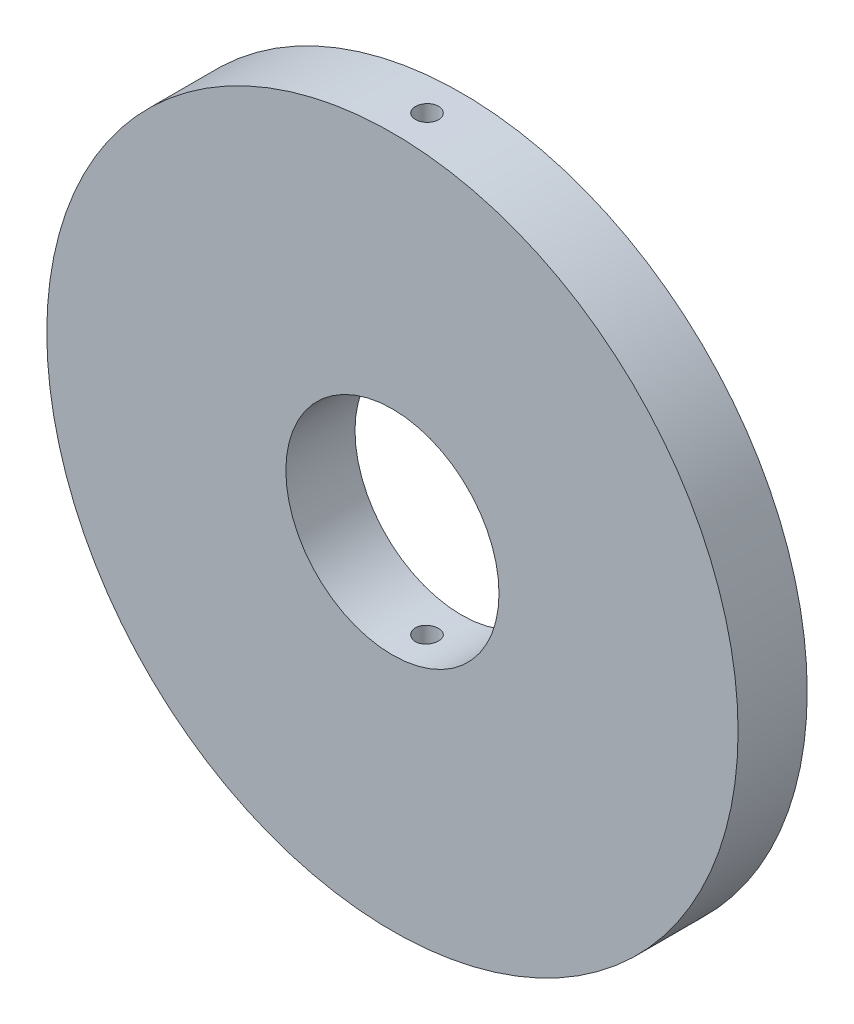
ISO-10303-21;
HEADER;
FILE_DESCRIPTION(('STEP AP214'),'2;1');
FILE_NAME('part.step','',(''),(''),'','','');
FILE_SCHEMA(('AUTOMOTIVE_DESIGN { 1 0 10303 214 1 1 1 1 }'));
ENDSEC;
DATA;
#1=APPLICATION_CONTEXT('core data for automotive mechanical design processes');
#2=APPLICATION_PROTOCOL_DEFINITION('international standard','automotive_design',2000,#1);
#3=PRODUCT_CONTEXT('',#1,'mechanical');
#4=PRODUCT('Part','Part','',(#3));
#5=PRODUCT_RELATED_PRODUCT_CATEGORY('part','',(#4));
#6=PRODUCT_DEFINITION_FORMATION('','',#4);
#7=PRODUCT_DEFINITION_CONTEXT('part definition',#1,'design');
#8=PRODUCT_DEFINITION('design','',#6,#7);
#9=PRODUCT_DEFINITION_SHAPE('','',#8);
#10=(LENGTH_UNIT() NAMED_UNIT(*) SI_UNIT(.MILLI.,.METRE.));
#11=(NAMED_UNIT(*) PLANE_ANGLE_UNIT() SI_UNIT($,.RADIAN.));
#12=(NAMED_UNIT(*) SI_UNIT($,.STERADIAN.) SOLID_ANGLE_UNIT());
#13=UNCERTAINTY_MEASURE_WITH_UNIT(LENGTH_MEASURE(1.E-05),#10,'distance_accuracy_value','');
#14=(GEOMETRIC_REPRESENTATION_CONTEXT(3) GLOBAL_UNCERTAINTY_ASSIGNED_CONTEXT((#13)) GLOBAL_UNIT_ASSIGNED_CONTEXT((#10,
#11,#12)) REPRESENTATION_CONTEXT('',''));
#15=CARTESIAN_POINT('',(0.,0.,0.));
#16=DIRECTION('',(0.,0.,1.));
#17=DIRECTION('',(1.,0.,0.));
#18=AXIS2_PLACEMENT_3D('',#15,#16,#17);
#19=CARTESIAN_POINT('',(0.,0.,6.));
#20=DIRECTION('',(0.,0.,1.));
#21=DIRECTION('',(1.,0.,0.));
#22=AXIS2_PLACEMENT_3D('',#19,#20,#21);
#23=PLANE('',#22);
#24=CARTESIAN_POINT('',(0.,0.,6.));
#25=DIRECTION('',(0.,0.,1.));
#26=DIRECTION('',(1.,0.,0.));
#27=AXIS2_PLACEMENT_3D('',#24,#25,#26);
#28=CIRCLE('',#27,60.);
#29=CARTESIAN_POINT('',(60.,0.,6.));
#30=VERTEX_POINT('',#29);
#31=EDGE_CURVE('E10',#30,#30,#28,.T.);
#32=ORIENTED_EDGE('',*,*,#31,.T.);
#33=EDGE_LOOP('',(#32));
#34=FACE_BOUND('',#33,.T.);
#35=CARTESIAN_POINT('',(0.,0.,6.));
#36=DIRECTION('',(0.,0.,1.));
#37=DIRECTION('',(1.,0.,0.));
#38=AXIS2_PLACEMENT_3D('',#35,#36,#37);
#39=CIRCLE('',#38,18.5);
#40=CARTESIAN_POINT('',(18.5,0.,6.));
#41=VERTEX_POINT('',#40);
#42=EDGE_CURVE('E49',#41,#41,#39,.T.);
#43=ORIENTED_EDGE('',*,*,#42,.F.);
#44=EDGE_LOOP('',(#43));
#45=FACE_BOUND('',#44,.T.);
#46=ADVANCED_FACE('F30',(#34,#45),#23,.T.);
#47=CARTESIAN_POINT('',(0.,0.,-6.));
#48=DIRECTION('',(0.,0.,1.));
#49=DIRECTION('',(1.,0.,0.));
#50=AXIS2_PLACEMENT_3D('',#47,#48,#49);
#51=PLANE('',#50);
#52=CARTESIAN_POINT('',(0.,0.,-6.));
#53=DIRECTION('',(0.,0.,1.));
#54=DIRECTION('',(1.,0.,0.));
#55=AXIS2_PLACEMENT_3D('',#52,#53,#54);
#56=CIRCLE('',#55,60.);
#57=CARTESIAN_POINT('',(60.,0.,-6.));
#58=VERTEX_POINT('',#57);
#59=EDGE_CURVE('E44',#58,#58,#56,.T.);
#60=ORIENTED_EDGE('',*,*,#59,.F.);
#61=EDGE_LOOP('',(#60));
#62=FACE_BOUND('',#61,.T.);
#63=CARTESIAN_POINT('',(0.,0.,-6.));
#64=DIRECTION('',(0.,0.,1.));
#65=DIRECTION('',(1.,0.,0.));
#66=AXIS2_PLACEMENT_3D('',#63,#64,#65);
#67=CIRCLE('',#66,18.5);
#68=CARTESIAN_POINT('',(18.5,0.,-6.));
#69=VERTEX_POINT('',#68);
#70=EDGE_CURVE('E52',#69,#69,#67,.T.);
#71=ORIENTED_EDGE('',*,*,#70,.T.);
#72=EDGE_LOOP('',(#71));
#73=FACE_BOUND('',#72,.T.);
#74=ADVANCED_FACE('F88',(#62,#73),#51,.F.);
#75=CARTESIAN_POINT('',(0.,0.,6.));
#76=DIRECTION('',(0.,0.,-1.));
#77=DIRECTION('',(-1.,0.,0.));
#78=AXIS2_PLACEMENT_3D('',#75,#76,#77);
#79=CYLINDRICAL_SURFACE('',#78,60.);
#80=CARTESIAN_POINT('',(0.,-60.,2.));
#81=CARTESIAN_POINT('',(0.11230741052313,-59.9999995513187,1.99999502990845));
#82=CARTESIAN_POINT('',(0.224695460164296,-59.999681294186,1.99050852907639));
#83=CARTESIAN_POINT('',(0.446374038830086,-59.9984422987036,1.95279792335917));
#84=CARTESIAN_POINT('',(0.555660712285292,-59.9975208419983,1.92455147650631));
#85=CARTESIAN_POINT('',(0.767893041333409,-59.9951797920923,1.85012804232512));
#86=CARTESIAN_POINT('',(0.870841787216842,-59.9937604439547,1.80395987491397));
#87=CARTESIAN_POINT('',(1.06749915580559,-59.9905836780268,1.69501631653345));
#88=CARTESIAN_POINT('',(1.16121001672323,-59.9888263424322,1.63224496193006));
#89=CARTESIAN_POINT('',(1.33680980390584,-59.9851704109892,1.49183842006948));
#90=CARTESIAN_POINT('',(1.41869337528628,-59.9832717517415,1.41419653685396));
#91=CARTESIAN_POINT('',(1.56826901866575,-59.9795477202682,1.24626501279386));
#92=CARTESIAN_POINT('',(1.63596052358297,-59.9777223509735,1.15597486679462));
#93=CARTESIAN_POINT('',(1.75524051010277,-59.9743503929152,0.965287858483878));
#94=CARTESIAN_POINT('',(1.80682553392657,-59.9728038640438,0.864888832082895));
#95=CARTESIAN_POINT('',(1.89240584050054,-59.9701646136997,0.65684939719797));
#96=CARTESIAN_POINT('',(1.92640120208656,-59.969071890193,0.549209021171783));
#97=CARTESIAN_POINT('',(1.97582500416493,-59.9674639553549,0.329785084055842));
#98=CARTESIAN_POINT('',(1.99126039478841,-59.966948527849,0.218003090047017));
#99=CARTESIAN_POINT('',(2.00314751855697,-59.9665526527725,-0.00656652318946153));
#100=CARTESIAN_POINT('',(1.99959933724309,-59.9666722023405,-0.119354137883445));
#101=CARTESIAN_POINT('',(1.97362589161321,-59.9675325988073,-0.342686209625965));
#102=CARTESIAN_POINT('',(1.95120813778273,-59.9682731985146,-0.453231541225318));
#103=CARTESIAN_POINT('',(1.88814352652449,-59.9702918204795,-0.668988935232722));
#104=CARTESIAN_POINT('',(1.84749662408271,-59.9715698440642,-0.774200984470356));
#105=CARTESIAN_POINT('',(1.74911891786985,-59.9745195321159,-0.976329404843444));
#106=CARTESIAN_POINT('',(1.69138467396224,-59.9761912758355,-1.07324410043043));
#107=CARTESIAN_POINT('',(1.56047369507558,-59.979739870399,-1.25600838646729));
#108=CARTESIAN_POINT('',(1.48729691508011,-59.981616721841,-1.3418579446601));
#109=CARTESIAN_POINT('',(1.32753561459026,-59.9853650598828,-1.50009874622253));
#110=CARTESIAN_POINT('',(1.24094458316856,-59.9872365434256,-1.57248341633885));
#111=CARTESIAN_POINT('',(1.05683574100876,-59.990762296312,-1.70168908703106));
#112=CARTESIAN_POINT('',(0.959317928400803,-59.9924165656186,-1.7585100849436));
#113=CARTESIAN_POINT('',(0.756120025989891,-59.9953214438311,-1.85497474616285));
#114=CARTESIAN_POINT('',(0.650439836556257,-59.9965720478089,-1.89461819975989));
#115=CARTESIAN_POINT('',(0.433918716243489,-59.9985285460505,-1.95559822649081));
#116=CARTESIAN_POINT('',(0.323077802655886,-59.9992344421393,-1.97693486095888));
#117=CARTESIAN_POINT('',(0.0994387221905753,-60.0000217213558,-2.00068751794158));
#118=CARTESIAN_POINT('',(-0.0133584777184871,-60.0001034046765,-2.00311263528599));
#119=CARTESIAN_POINT('',(-0.237758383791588,-59.9996338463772,-1.98899712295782));
#120=CARTESIAN_POINT('',(-0.349361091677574,-59.9990826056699,-1.97245652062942));
#121=CARTESIAN_POINT('',(-0.568178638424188,-59.9974095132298,-1.92088662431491));
#122=CARTESIAN_POINT('',(-0.675394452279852,-59.9962877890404,-1.88586146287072));
#123=CARTESIAN_POINT('',(-0.882424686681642,-59.9936001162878,-1.79832087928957));
#124=CARTESIAN_POINT('',(-0.982239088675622,-59.9920341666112,-1.74580541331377));
#125=CARTESIAN_POINT('',(-1.17167497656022,-59.9886336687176,-1.62475154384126));
#126=CARTESIAN_POINT('',(-1.26129255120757,-59.9867990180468,-1.55620702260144));
#127=CARTESIAN_POINT('',(-1.42775157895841,-59.9830682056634,-1.40504974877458));
#128=CARTESIAN_POINT('',(-1.50459299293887,-59.9811720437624,-1.32243695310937));
#129=CARTESIAN_POINT('',(-1.64334885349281,-59.977531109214,-1.14544921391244));
#130=CARTESIAN_POINT('',(-1.70525742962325,-59.9757863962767,-1.05106966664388));
#131=CARTESIAN_POINT('',(-1.81235012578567,-59.9726460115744,-0.853250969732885));
#132=CARTESIAN_POINT('',(-1.85753428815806,-59.9712503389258,-0.749811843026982));
#133=CARTESIAN_POINT('',(-1.92988526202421,-59.96896582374,-0.536832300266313));
#134=CARTESIAN_POINT('',(-1.95705586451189,-59.9680768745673,-0.427293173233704));
#135=CARTESIAN_POINT('',(-1.99262086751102,-59.9669057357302,-0.205204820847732));
#136=CARTESIAN_POINT('',(-2.00101529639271,-59.9666235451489,-0.0926556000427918));
#137=CARTESIAN_POINT('',(-1.99878923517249,-59.96669777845,0.132199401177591));
#138=CARTESIAN_POINT('',(-1.98817799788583,-59.9670538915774,0.244505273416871));
#139=CARTESIAN_POINT('',(-1.94826086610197,-59.968363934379,0.465740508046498));
#140=CARTESIAN_POINT('',(-1.91895493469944,-59.9693178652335,0.574669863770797));
#141=CARTESIAN_POINT('',(-1.84248173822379,-59.9717159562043,0.786063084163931));
#142=CARTESIAN_POINT('',(-1.79531418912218,-59.9731601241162,0.888526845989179));
#143=CARTESIAN_POINT('',(-1.68445939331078,-59.9763758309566,1.0840795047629));
#144=CARTESIAN_POINT('',(-1.62077273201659,-59.9781473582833,1.1771687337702));
#145=CARTESIAN_POINT('',(-1.47865855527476,-59.9818189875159,1.35137347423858));
#146=CARTESIAN_POINT('',(-1.40022544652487,-59.9837191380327,1.43248442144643));
#147=CARTESIAN_POINT('',(-1.23083249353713,-59.9874337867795,1.58041021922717));
#148=CARTESIAN_POINT('',(-1.13986955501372,-59.9892482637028,1.64722152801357));
#149=CARTESIAN_POINT('',(-0.947958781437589,-59.9925877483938,1.76466546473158));
#150=CARTESIAN_POINT('',(-0.847004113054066,-59.994112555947,1.81528691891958));
#151=CARTESIAN_POINT('',(-0.638101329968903,-59.9966973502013,1.89880272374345));
#152=CARTESIAN_POINT('',(-0.530161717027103,-59.997757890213,1.93171818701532));
#153=CARTESIAN_POINT('',(-0.351284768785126,-59.9990115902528,1.97017649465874));
#154=CARTESIAN_POINT('',(-0.281508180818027,-59.9993806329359,1.98134620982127));
#155=CARTESIAN_POINT('',(-0.141165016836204,-59.9998749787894,1.99625952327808));
#156=CARTESIAN_POINT('',(-0.0705984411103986,-60.0000002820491,2.00000312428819));
#157=CARTESIAN_POINT('',(0.,-60.,2.));
#158=B_SPLINE_CURVE_WITH_KNOTS('',3,(#80,#81,#82,#83,#84,#85,#86,#87,#88,#89,#90,#91,#92,#93,
#94,#95,#96,#97,#98,#99,#100,#101,#102,#103,#104,#105,#106,#107,#108,#109,#110,#111,#112,#113,
#114,#115,#116,#117,#118,#119,#120,#121,#122,#123,#124,#125,#126,#127,#128,#129,#130,#131,#132,
#133,#134,#135,#136,#137,#138,#139,#140,#141,#142,#143,#144,#145,#146,#147,#148,#149,#150,#151,
#152,#153,#154,#155,#156,#157),.UNSPECIFIED.,.T.,.F.,(4,2,2,2,2,2,2,2,2,2,2,2,2,2,2,2,2,2,2,2,2,
2,2,2,2,2,2,2,2,2,2,2,2,2,2,2,2,2,4),(0.,0.336664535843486,0.673730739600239,1.0106312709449,
1.34744997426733,1.68442069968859,2.02140488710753,2.3584613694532,2.69551634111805,
3.03244505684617,3.3693722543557,3.70616541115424,4.04295939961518,4.37982123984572,
4.71668406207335,5.05371090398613,5.39073780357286,5.72776881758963,6.06479870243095,
6.40166649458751,6.73853380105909,7.07532582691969,7.41211869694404,7.74904031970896,
8.08596297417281,8.42301786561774,8.76007190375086,9.09705498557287,9.43403755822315,
9.77085611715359,10.1076753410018,10.4444999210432,10.7813125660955,11.1182532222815,
11.4552772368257,11.7925333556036,12.129386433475,12.3410198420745,12.5526531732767),.UNSPECIFIED.);
#159=CARTESIAN_POINT('',(0.,-60.,2.));
#160=VERTEX_POINT('',#159);
#161=EDGE_CURVE('E77',#160,#160,#158,.T.);
#162=ORIENTED_EDGE('',*,*,#161,.T.);
#163=EDGE_LOOP('',(#162));
#164=FACE_BOUND('',#163,.T.);
#165=CARTESIAN_POINT('',(0.,60.,2.));
#166=CARTESIAN_POINT('',(-0.11230741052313,59.9999995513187,1.99999502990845));
#167=CARTESIAN_POINT('',(-0.224695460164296,59.999681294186,1.99050852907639));
#168=CARTESIAN_POINT('',(-0.446374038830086,59.9984422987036,1.95279792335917));
#169=CARTESIAN_POINT('',(-0.555660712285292,59.9975208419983,1.92455147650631));
#170=CARTESIAN_POINT('',(-0.767893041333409,59.9951797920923,1.85012804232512));
#171=CARTESIAN_POINT('',(-0.870841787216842,59.9937604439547,1.80395987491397));
#172=CARTESIAN_POINT('',(-1.06749915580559,59.9905836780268,1.69501631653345));
#173=CARTESIAN_POINT('',(-1.16121001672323,59.9888263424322,1.63224496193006));
#174=CARTESIAN_POINT('',(-1.33680980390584,59.9851704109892,1.49183842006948));
#175=CARTESIAN_POINT('',(-1.41869337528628,59.9832717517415,1.41419653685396));
#176=CARTESIAN_POINT('',(-1.56826901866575,59.9795477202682,1.24626501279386));
#177=CARTESIAN_POINT('',(-1.63596052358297,59.9777223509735,1.15597486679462));
#178=CARTESIAN_POINT('',(-1.75524051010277,59.9743503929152,0.965287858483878));
#179=CARTESIAN_POINT('',(-1.80682553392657,59.9728038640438,0.864888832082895));
#180=CARTESIAN_POINT('',(-1.89240584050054,59.9701646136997,0.65684939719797));
#181=CARTESIAN_POINT('',(-1.92640120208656,59.969071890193,0.549209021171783));
#182=CARTESIAN_POINT('',(-1.97582500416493,59.9674639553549,0.329785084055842));
#183=CARTESIAN_POINT('',(-1.99126039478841,59.966948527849,0.218003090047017));
#184=CARTESIAN_POINT('',(-2.00314751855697,59.9665526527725,-0.00656652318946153));
#185=CARTESIAN_POINT('',(-1.99959933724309,59.9666722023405,-0.119354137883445));
#186=CARTESIAN_POINT('',(-1.97362589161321,59.9675325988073,-0.342686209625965));
#187=CARTESIAN_POINT('',(-1.95120813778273,59.9682731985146,-0.453231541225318));
#188=CARTESIAN_POINT('',(-1.88814352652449,59.9702918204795,-0.668988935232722));
#189=CARTESIAN_POINT('',(-1.84749662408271,59.9715698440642,-0.774200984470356));
#190=CARTESIAN_POINT('',(-1.74911891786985,59.9745195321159,-0.976329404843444));
#191=CARTESIAN_POINT('',(-1.69138467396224,59.9761912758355,-1.07324410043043));
#192=CARTESIAN_POINT('',(-1.56047369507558,59.979739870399,-1.25600838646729));
#193=CARTESIAN_POINT('',(-1.48729691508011,59.981616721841,-1.3418579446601));
#194=CARTESIAN_POINT('',(-1.32753561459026,59.9853650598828,-1.50009874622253));
#195=CARTESIAN_POINT('',(-1.24094458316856,59.9872365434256,-1.57248341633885));
#196=CARTESIAN_POINT('',(-1.05683574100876,59.990762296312,-1.70168908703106));
#197=CARTESIAN_POINT('',(-0.959317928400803,59.9924165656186,-1.7585100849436));
#198=CARTESIAN_POINT('',(-0.756120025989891,59.9953214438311,-1.85497474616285));
#199=CARTESIAN_POINT('',(-0.650439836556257,59.9965720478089,-1.89461819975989));
#200=CARTESIAN_POINT('',(-0.433918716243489,59.9985285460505,-1.95559822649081));
#201=CARTESIAN_POINT('',(-0.323077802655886,59.9992344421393,-1.97693486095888));
#202=CARTESIAN_POINT('',(-0.0994387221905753,60.0000217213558,-2.00068751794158));
#203=CARTESIAN_POINT('',(0.0133584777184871,60.0001034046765,-2.00311263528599));
#204=CARTESIAN_POINT('',(0.237758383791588,59.9996338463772,-1.98899712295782));
#205=CARTESIAN_POINT('',(0.349361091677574,59.9990826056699,-1.97245652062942));
#206=CARTESIAN_POINT('',(0.568178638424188,59.9974095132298,-1.92088662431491));
#207=CARTESIAN_POINT('',(0.675394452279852,59.9962877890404,-1.88586146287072));
#208=CARTESIAN_POINT('',(0.882424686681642,59.9936001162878,-1.79832087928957));
#209=CARTESIAN_POINT('',(0.982239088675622,59.9920341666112,-1.74580541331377));
#210=CARTESIAN_POINT('',(1.17167497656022,59.9886336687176,-1.62475154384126));
#211=CARTESIAN_POINT('',(1.26129255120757,59.9867990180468,-1.55620702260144));
#212=CARTESIAN_POINT('',(1.42775157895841,59.9830682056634,-1.40504974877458));
#213=CARTESIAN_POINT('',(1.50459299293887,59.9811720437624,-1.32243695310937));
#214=CARTESIAN_POINT('',(1.64334885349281,59.977531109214,-1.14544921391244));
#215=CARTESIAN_POINT('',(1.70525742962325,59.9757863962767,-1.05106966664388));
#216=CARTESIAN_POINT('',(1.81235012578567,59.9726460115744,-0.853250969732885));
#217=CARTESIAN_POINT('',(1.85753428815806,59.9712503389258,-0.749811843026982));
#218=CARTESIAN_POINT('',(1.92988526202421,59.96896582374,-0.536832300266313));
#219=CARTESIAN_POINT('',(1.95705586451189,59.9680768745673,-0.427293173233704));
#220=CARTESIAN_POINT('',(1.99262086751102,59.9669057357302,-0.205204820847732));
#221=CARTESIAN_POINT('',(2.00101529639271,59.9666235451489,-0.0926556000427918));
#222=CARTESIAN_POINT('',(1.99878923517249,59.96669777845,0.132199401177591));
#223=CARTESIAN_POINT('',(1.98817799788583,59.9670538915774,0.244505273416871));
#224=CARTESIAN_POINT('',(1.94826086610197,59.968363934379,0.465740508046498));
#225=CARTESIAN_POINT('',(1.91895493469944,59.9693178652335,0.574669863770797));
#226=CARTESIAN_POINT('',(1.84248173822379,59.9717159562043,0.786063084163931));
#227=CARTESIAN_POINT('',(1.79531418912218,59.9731601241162,0.888526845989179));
#228=CARTESIAN_POINT('',(1.68445939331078,59.9763758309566,1.0840795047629));
#229=CARTESIAN_POINT('',(1.62077273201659,59.9781473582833,1.1771687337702));
#230=CARTESIAN_POINT('',(1.47865855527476,59.9818189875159,1.35137347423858));
#231=CARTESIAN_POINT('',(1.40022544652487,59.9837191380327,1.43248442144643));
#232=CARTESIAN_POINT('',(1.23083249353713,59.9874337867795,1.58041021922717));
#233=CARTESIAN_POINT('',(1.13986955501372,59.9892482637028,1.64722152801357));
#234=CARTESIAN_POINT('',(0.947958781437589,59.9925877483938,1.76466546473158));
#235=CARTESIAN_POINT('',(0.847004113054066,59.994112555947,1.81528691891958));
#236=CARTESIAN_POINT('',(0.638101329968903,59.9966973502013,1.89880272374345));
#237=CARTESIAN_POINT('',(0.530161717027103,59.997757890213,1.93171818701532));
#238=CARTESIAN_POINT('',(0.351284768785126,59.9990115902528,1.97017649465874));
#239=CARTESIAN_POINT('',(0.281508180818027,59.9993806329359,1.98134620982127));
#240=CARTESIAN_POINT('',(0.141165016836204,59.9998749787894,1.99625952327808));
#241=CARTESIAN_POINT('',(0.0705984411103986,60.0000002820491,2.00000312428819));
#242=CARTESIAN_POINT('',(0.,60.,2.));
#243=B_SPLINE_CURVE_WITH_KNOTS('',3,(#165,#166,#167,#168,#169,#170,#171,#172,#173,#174,#175,
#176,#177,#178,#179,#180,#181,#182,#183,#184,#185,#186,#187,#188,#189,#190,#191,#192,#193,#194,
#195,#196,#197,#198,#199,#200,#201,#202,#203,#204,#205,#206,#207,#208,#209,#210,#211,#212,#213,
#214,#215,#216,#217,#218,#219,#220,#221,#222,#223,#224,#225,#226,#227,#228,#229,#230,#231,#232,
#233,#234,#235,#236,#237,#238,#239,#240,#241,#242),.UNSPECIFIED.,.T.,.F.,(4,2,2,2,2,2,2,2,2,2,2,
2,2,2,2,2,2,2,2,2,2,2,2,2,2,2,2,2,2,2,2,2,2,2,2,2,2,2,4),(0.,0.336664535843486,
0.673730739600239,1.0106312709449,1.34744997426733,1.68442069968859,2.02140488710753,
2.3584613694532,2.69551634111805,3.03244505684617,3.3693722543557,3.70616541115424,
4.04295939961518,4.37982123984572,4.71668406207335,5.05371090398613,5.39073780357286,
5.72776881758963,6.06479870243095,6.40166649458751,6.73853380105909,7.07532582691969,
7.41211869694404,7.74904031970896,8.08596297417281,8.42301786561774,8.76007190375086,
9.09705498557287,9.43403755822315,9.77085611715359,10.1076753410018,10.4444999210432,
10.7813125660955,11.1182532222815,11.4552772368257,11.7925333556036,12.129386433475,
12.3410198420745,12.5526531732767),.UNSPECIFIED.);
#244=CARTESIAN_POINT('',(0.,60.,2.));
#245=VERTEX_POINT('',#244);
#246=EDGE_CURVE('E72',#245,#245,#243,.T.);
#247=ORIENTED_EDGE('',*,*,#246,.T.);
#248=EDGE_LOOP('',(#247));
#249=FACE_BOUND('',#248,.T.);
#250=ORIENTED_EDGE('',*,*,#31,.F.);
#251=EDGE_LOOP('',(#250));
#252=FACE_BOUND('',#251,.T.);
#253=ORIENTED_EDGE('',*,*,#59,.T.);
#254=EDGE_LOOP('',(#253));
#255=FACE_BOUND('',#254,.T.);
#256=ADVANCED_FACE('F32',(#164,#249,#252,#255),#79,.T.);
#257=CARTESIAN_POINT('',(0.,0.,6.));
#258=DIRECTION('',(0.,0.,-1.));
#259=DIRECTION('',(-1.,0.,0.));
#260=AXIS2_PLACEMENT_3D('',#257,#258,#259);
#261=CYLINDRICAL_SURFACE('',#260,18.5);
#262=CARTESIAN_POINT('',(0.,-18.5,2.));
#263=CARTESIAN_POINT('',(0.111990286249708,-18.499998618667,1.9999951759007));
#264=CARTESIAN_POINT('',(0.224053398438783,-18.4989723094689,1.99056194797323));
#265=CARTESIAN_POINT('',(0.44506934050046,-18.4949768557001,1.95307530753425));
#266=CARTESIAN_POINT('',(0.554018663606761,-18.4920056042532,1.92500170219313));
#267=CARTESIAN_POINT('',(0.765574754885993,-18.4844554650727,1.85106413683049));
#268=CARTESIAN_POINT('',(0.868185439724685,-18.4798775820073,1.80521129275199));
#269=CARTESIAN_POINT('',(1.06423297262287,-18.4696252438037,1.69703928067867));
#270=CARTESIAN_POINT('',(1.1576715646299,-18.4639509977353,1.63472325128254));
#271=CARTESIAN_POINT('',(1.33313392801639,-18.4521144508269,1.49511510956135));
#272=CARTESIAN_POINT('',(1.41511399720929,-18.4459504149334,1.41776821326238));
#273=CARTESIAN_POINT('',(1.56495633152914,-18.4338432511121,1.25041109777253));
#274=CARTESIAN_POINT('',(1.63281792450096,-18.4279001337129,1.16040027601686));
#275=CARTESIAN_POINT('',(1.75265443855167,-18.4168902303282,0.969993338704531));
#276=CARTESIAN_POINT('',(1.80458934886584,-18.4118256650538,0.869571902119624));
#277=CARTESIAN_POINT('',(1.89084277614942,-18.4031683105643,0.661369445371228));
#278=CARTESIAN_POINT('',(1.92516179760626,-18.399575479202,0.553588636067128));
#279=CARTESIAN_POINT('',(1.97507860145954,-18.3942843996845,0.334175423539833));
#280=CARTESIAN_POINT('',(1.99074932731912,-18.3925787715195,0.222559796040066));
#281=CARTESIAN_POINT('',(2.00315025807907,-18.3912324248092,-0.00172931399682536));
#282=CARTESIAN_POINT('',(1.99988103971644,-18.3915916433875,-0.114402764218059));
#283=CARTESIAN_POINT('',(1.974554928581,-18.3943276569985,-0.337104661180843));
#284=CARTESIAN_POINT('',(1.95257788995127,-18.3966958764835,-0.447142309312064));
#285=CARTESIAN_POINT('',(1.89058433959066,-18.4031696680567,-0.661958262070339));
#286=CARTESIAN_POINT('',(1.85056754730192,-18.407275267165,-0.766736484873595));
#287=CARTESIAN_POINT('',(1.75354297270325,-18.4167710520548,-0.968310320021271));
#288=CARTESIAN_POINT('',(1.69649998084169,-18.4221638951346,-1.06508885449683));
#289=CARTESIAN_POINT('',(1.56706751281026,-18.4336243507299,-1.2477291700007));
#290=CARTESIAN_POINT('',(1.49467751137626,-18.4396919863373,-1.33359057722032));
#291=CARTESIAN_POINT('',(1.33616094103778,-18.4518565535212,-1.49242322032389));
#292=CARTESIAN_POINT('',(1.24996544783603,-18.4579534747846,-1.5653256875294));
#293=CARTESIAN_POINT('',(1.06652339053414,-18.4694601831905,-1.69563727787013));
#294=CARTESIAN_POINT('',(0.969276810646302,-18.4748699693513,-1.75304637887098));
#295=CARTESIAN_POINT('',(0.766443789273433,-18.4843950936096,-1.85073968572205));
#296=CARTESIAN_POINT('',(0.660855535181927,-18.4885101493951,-1.89102015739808));
#297=CARTESIAN_POINT('',(0.444359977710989,-18.4949793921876,-1.95326113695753));
#298=CARTESIAN_POINT('',(0.333452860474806,-18.4973336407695,-1.97522228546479));
#299=CARTESIAN_POINT('',(0.110063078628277,-18.5000080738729,-2.00011341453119));
#300=CARTESIAN_POINT('',(-0.00240890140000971,-18.5003383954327,-2.00313824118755));
#301=CARTESIAN_POINT('',(-0.22625817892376,-18.4989549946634,-1.99032033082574));
#302=CARTESIAN_POINT('',(-0.337635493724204,-18.4972413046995,-1.97447789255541));
#303=CARTESIAN_POINT('',(-0.555858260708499,-18.4919688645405,-1.92445388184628));
#304=CARTESIAN_POINT('',(-0.662714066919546,-18.4884146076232,-1.89031696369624));
#305=CARTESIAN_POINT('',(-0.869183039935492,-18.47985951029,-1.80471906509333));
#306=CARTESIAN_POINT('',(-0.968796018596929,-18.4748586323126,-1.75325763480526));
#307=CARTESIAN_POINT('',(-1.15837895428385,-18.4639438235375,-1.63423802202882));
#308=CARTESIAN_POINT('',(-1.24830976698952,-18.4580264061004,-1.5666178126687));
#309=CARTESIAN_POINT('',(-1.4155787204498,-18.4459530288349,-1.41728870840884));
#310=CARTESIAN_POINT('',(-1.49291649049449,-18.4397970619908,-1.33557939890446));
#311=CARTESIAN_POINT('',(-1.63313551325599,-18.4279096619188,-1.15997646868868));
#312=CARTESIAN_POINT('',(-1.6959543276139,-18.4221801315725,-1.06603284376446));
#313=CARTESIAN_POINT('',(-1.80492238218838,-18.4118240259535,-0.868873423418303));
#314=CARTESIAN_POINT('',(-1.85107188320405,-18.4071974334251,-0.765657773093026));
#315=CARTESIAN_POINT('',(-1.92528779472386,-18.3995832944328,-0.553094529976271));
#316=CARTESIAN_POINT('',(-1.9533907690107,-18.3965924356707,-0.443759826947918));
#317=CARTESIAN_POINT('',(-1.99083427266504,-18.3925783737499,-0.221889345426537));
#318=CARTESIAN_POINT('',(-2.00017543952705,-18.3915551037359,-0.109353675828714));
#319=CARTESIAN_POINT('',(-1.9998204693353,-18.3915936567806,0.115103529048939));
#320=CARTESIAN_POINT('',(-1.99022241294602,-18.3926447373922,0.227025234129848));
#321=CARTESIAN_POINT('',(-1.95246771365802,-18.3966906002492,0.447655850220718));
#322=CARTESIAN_POINT('',(-1.92431105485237,-18.3996853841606,0.556364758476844));
#323=CARTESIAN_POINT('',(-1.85026659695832,-18.4072781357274,0.767479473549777));
#324=CARTESIAN_POINT('',(-1.80438224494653,-18.411875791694,0.869886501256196));
#325=CARTESIAN_POINT('',(-1.69619478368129,-18.4221568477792,1.06556188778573));
#326=CARTESIAN_POINT('',(-1.63389167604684,-18.4278402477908,1.15883024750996));
#327=CARTESIAN_POINT('',(-1.49426797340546,-18.4396877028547,1.33408321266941));
#328=CARTESIAN_POINT('',(-1.41687422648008,-18.4458540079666,1.41600938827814));
#329=CARTESIAN_POINT('',(-1.2494143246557,-18.4579521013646,1.56575273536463));
#330=CARTESIAN_POINT('',(-1.15934515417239,-18.4638838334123,1.63356653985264));
#331=CARTESIAN_POINT('',(-0.968800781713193,-18.4748626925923,1.75331919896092));
#332=CARTESIAN_POINT('',(-0.868296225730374,-18.4799072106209,1.80521155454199));
#333=CARTESIAN_POINT('',(-0.660007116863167,-18.4885156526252,1.89131234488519));
#334=CARTESIAN_POINT('',(-0.55223083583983,-18.4920812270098,1.925540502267));
#335=CARTESIAN_POINT('',(-0.369882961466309,-18.4964449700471,1.96690828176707));
#336=CARTESIAN_POINT('',(-0.296472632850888,-18.4977718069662,1.97930046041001));
#337=CARTESIAN_POINT('',(-0.148718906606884,-18.4995497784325,1.99584790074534));
#338=CARTESIAN_POINT('',(-0.074375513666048,-18.5000009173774,2.00000320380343));
#339=CARTESIAN_POINT('',(0.,-18.5,2.));
#340=B_SPLINE_CURVE_WITH_KNOTS('',3,(#262,#263,#264,#265,#266,#267,#268,#269,#270,#271,#272,
#273,#274,#275,#276,#277,#278,#279,#280,#281,#282,#283,#284,#285,#286,#287,#288,#289,#290,#291,
#292,#293,#294,#295,#296,#297,#298,#299,#300,#301,#302,#303,#304,#305,#306,#307,#308,#309,#310,
#311,#312,#313,#314,#315,#316,#317,#318,#319,#320,#321,#322,#323,#324,#325,#326,#327,#328,#329,
#330,#331,#332,#333,#334,#335,#336,#337,#338,#339),.UNSPECIFIED.,.T.,.F.,(4,2,2,2,2,2,2,2,2,2,2,
2,2,2,2,2,2,2,2,2,2,2,2,2,2,2,2,2,2,2,2,2,2,2,2,2,2,2,4),(0.,0.335699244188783,
0.671762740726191,1.00761646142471,1.34340619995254,1.68044357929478,2.01749700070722,
2.35539035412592,2.69327403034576,3.02983167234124,3.36637906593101,3.70149707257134,
4.03662029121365,4.37244139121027,4.70827398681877,5.04583872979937,5.38340395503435,
5.72104273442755,6.05866970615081,6.39460424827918,6.73053347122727,7.06564644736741,
7.40076812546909,7.73719746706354,8.07363671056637,8.41149694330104,8.74935188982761,
9.08652013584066,9.42367692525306,9.75909226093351,10.0945078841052,10.4298583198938,
10.7652087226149,11.1022270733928,11.4393257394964,11.7773997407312,12.1150954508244,
12.3380427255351,12.5609888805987),.UNSPECIFIED.);
#341=CARTESIAN_POINT('',(0.,-18.5,2.));
#342=VERTEX_POINT('',#341);
#343=EDGE_CURVE('E35',#342,#342,#340,.T.);
#344=ORIENTED_EDGE('',*,*,#343,.F.);
#345=EDGE_LOOP('',(#344));
#346=FACE_BOUND('',#345,.T.);
#347=CARTESIAN_POINT('',(0.,18.5,2.));
#348=CARTESIAN_POINT('',(-0.111990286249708,18.499998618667,1.9999951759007));
#349=CARTESIAN_POINT('',(-0.224053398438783,18.4989723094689,1.99056194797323));
#350=CARTESIAN_POINT('',(-0.44506934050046,18.4949768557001,1.95307530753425));
#351=CARTESIAN_POINT('',(-0.554018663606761,18.4920056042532,1.92500170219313));
#352=CARTESIAN_POINT('',(-0.765574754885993,18.4844554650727,1.85106413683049));
#353=CARTESIAN_POINT('',(-0.868185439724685,18.4798775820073,1.80521129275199));
#354=CARTESIAN_POINT('',(-1.06423297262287,18.4696252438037,1.69703928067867));
#355=CARTESIAN_POINT('',(-1.1576715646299,18.4639509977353,1.63472325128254));
#356=CARTESIAN_POINT('',(-1.33313392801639,18.4521144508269,1.49511510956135));
#357=CARTESIAN_POINT('',(-1.41511399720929,18.4459504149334,1.41776821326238));
#358=CARTESIAN_POINT('',(-1.56495633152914,18.4338432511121,1.25041109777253));
#359=CARTESIAN_POINT('',(-1.63281792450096,18.4279001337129,1.16040027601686));
#360=CARTESIAN_POINT('',(-1.75265443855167,18.4168902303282,0.969993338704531));
#361=CARTESIAN_POINT('',(-1.80458934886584,18.4118256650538,0.869571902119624));
#362=CARTESIAN_POINT('',(-1.89084277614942,18.4031683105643,0.661369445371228));
#363=CARTESIAN_POINT('',(-1.92516179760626,18.399575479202,0.553588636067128));
#364=CARTESIAN_POINT('',(-1.97507860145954,18.3942843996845,0.334175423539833));
#365=CARTESIAN_POINT('',(-1.99074932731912,18.3925787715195,0.222559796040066));
#366=CARTESIAN_POINT('',(-2.00315025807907,18.3912324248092,-0.00172931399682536));
#367=CARTESIAN_POINT('',(-1.99988103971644,18.3915916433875,-0.114402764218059));
#368=CARTESIAN_POINT('',(-1.974554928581,18.3943276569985,-0.337104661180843));
#369=CARTESIAN_POINT('',(-1.95257788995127,18.3966958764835,-0.447142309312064));
#370=CARTESIAN_POINT('',(-1.89058433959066,18.4031696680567,-0.661958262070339));
#371=CARTESIAN_POINT('',(-1.85056754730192,18.407275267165,-0.766736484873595));
#372=CARTESIAN_POINT('',(-1.75354297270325,18.4167710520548,-0.968310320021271));
#373=CARTESIAN_POINT('',(-1.69649998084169,18.4221638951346,-1.06508885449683));
#374=CARTESIAN_POINT('',(-1.56706751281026,18.4336243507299,-1.2477291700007));
#375=CARTESIAN_POINT('',(-1.49467751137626,18.4396919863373,-1.33359057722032));
#376=CARTESIAN_POINT('',(-1.33616094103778,18.4518565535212,-1.49242322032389));
#377=CARTESIAN_POINT('',(-1.24996544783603,18.4579534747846,-1.5653256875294));
#378=CARTESIAN_POINT('',(-1.06652339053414,18.4694601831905,-1.69563727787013));
#379=CARTESIAN_POINT('',(-0.969276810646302,18.4748699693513,-1.75304637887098));
#380=CARTESIAN_POINT('',(-0.766443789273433,18.4843950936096,-1.85073968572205));
#381=CARTESIAN_POINT('',(-0.660855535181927,18.4885101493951,-1.89102015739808));
#382=CARTESIAN_POINT('',(-0.444359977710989,18.4949793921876,-1.95326113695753));
#383=CARTESIAN_POINT('',(-0.333452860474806,18.4973336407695,-1.97522228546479));
#384=CARTESIAN_POINT('',(-0.110063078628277,18.5000080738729,-2.00011341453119));
#385=CARTESIAN_POINT('',(0.00240890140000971,18.5003383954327,-2.00313824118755));
#386=CARTESIAN_POINT('',(0.22625817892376,18.4989549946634,-1.99032033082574));
#387=CARTESIAN_POINT('',(0.337635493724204,18.4972413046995,-1.97447789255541));
#388=CARTESIAN_POINT('',(0.555858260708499,18.4919688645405,-1.92445388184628));
#389=CARTESIAN_POINT('',(0.662714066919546,18.4884146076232,-1.89031696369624));
#390=CARTESIAN_POINT('',(0.869183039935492,18.47985951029,-1.80471906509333));
#391=CARTESIAN_POINT('',(0.968796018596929,18.4748586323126,-1.75325763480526));
#392=CARTESIAN_POINT('',(1.15837895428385,18.4639438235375,-1.63423802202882));
#393=CARTESIAN_POINT('',(1.24830976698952,18.4580264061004,-1.5666178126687));
#394=CARTESIAN_POINT('',(1.4155787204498,18.4459530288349,-1.41728870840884));
#395=CARTESIAN_POINT('',(1.49291649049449,18.4397970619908,-1.33557939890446));
#396=CARTESIAN_POINT('',(1.63313551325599,18.4279096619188,-1.15997646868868));
#397=CARTESIAN_POINT('',(1.6959543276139,18.4221801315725,-1.06603284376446));
#398=CARTESIAN_POINT('',(1.80492238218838,18.4118240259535,-0.868873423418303));
#399=CARTESIAN_POINT('',(1.85107188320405,18.4071974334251,-0.765657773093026));
#400=CARTESIAN_POINT('',(1.92528779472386,18.3995832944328,-0.553094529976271));
#401=CARTESIAN_POINT('',(1.9533907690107,18.3965924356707,-0.443759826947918));
#402=CARTESIAN_POINT('',(1.99083427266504,18.3925783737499,-0.221889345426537));
#403=CARTESIAN_POINT('',(2.00017543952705,18.3915551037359,-0.109353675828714));
#404=CARTESIAN_POINT('',(1.9998204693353,18.3915936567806,0.115103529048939));
#405=CARTESIAN_POINT('',(1.99022241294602,18.3926447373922,0.227025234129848));
#406=CARTESIAN_POINT('',(1.95246771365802,18.3966906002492,0.447655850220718));
#407=CARTESIAN_POINT('',(1.92431105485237,18.3996853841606,0.556364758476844));
#408=CARTESIAN_POINT('',(1.85026659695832,18.4072781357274,0.767479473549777));
#409=CARTESIAN_POINT('',(1.80438224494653,18.411875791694,0.869886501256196));
#410=CARTESIAN_POINT('',(1.69619478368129,18.4221568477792,1.06556188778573));
#411=CARTESIAN_POINT('',(1.63389167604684,18.4278402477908,1.15883024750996));
#412=CARTESIAN_POINT('',(1.49426797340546,18.4396877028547,1.33408321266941));
#413=CARTESIAN_POINT('',(1.41687422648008,18.4458540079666,1.41600938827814));
#414=CARTESIAN_POINT('',(1.2494143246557,18.4579521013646,1.56575273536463));
#415=CARTESIAN_POINT('',(1.15934515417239,18.4638838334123,1.63356653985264));
#416=CARTESIAN_POINT('',(0.968800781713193,18.4748626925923,1.75331919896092));
#417=CARTESIAN_POINT('',(0.868296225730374,18.4799072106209,1.80521155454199));
#418=CARTESIAN_POINT('',(0.660007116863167,18.4885156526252,1.89131234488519));
#419=CARTESIAN_POINT('',(0.55223083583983,18.4920812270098,1.925540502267));
#420=CARTESIAN_POINT('',(0.369882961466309,18.4964449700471,1.96690828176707));
#421=CARTESIAN_POINT('',(0.296472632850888,18.4977718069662,1.97930046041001));
#422=CARTESIAN_POINT('',(0.148718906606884,18.4995497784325,1.99584790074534));
#423=CARTESIAN_POINT('',(0.074375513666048,18.5000009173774,2.00000320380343));
#424=CARTESIAN_POINT('',(0.,18.5,2.));
#425=B_SPLINE_CURVE_WITH_KNOTS('',3,(#347,#348,#349,#350,#351,#352,#353,#354,#355,#356,#357,
#358,#359,#360,#361,#362,#363,#364,#365,#366,#367,#368,#369,#370,#371,#372,#373,#374,#375,#376,
#377,#378,#379,#380,#381,#382,#383,#384,#385,#386,#387,#388,#389,#390,#391,#392,#393,#394,#395,
#396,#397,#398,#399,#400,#401,#402,#403,#404,#405,#406,#407,#408,#409,#410,#411,#412,#413,#414,
#415,#416,#417,#418,#419,#420,#421,#422,#423,#424),.UNSPECIFIED.,.T.,.F.,(4,2,2,2,2,2,2,2,2,2,2,
2,2,2,2,2,2,2,2,2,2,2,2,2,2,2,2,2,2,2,2,2,2,2,2,2,2,2,4),(0.,0.335699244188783,
0.671762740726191,1.00761646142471,1.34340619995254,1.68044357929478,2.01749700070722,
2.35539035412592,2.69327403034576,3.02983167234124,3.36637906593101,3.70149707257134,
4.03662029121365,4.37244139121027,4.70827398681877,5.04583872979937,5.38340395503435,
5.72104273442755,6.05866970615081,6.39460424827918,6.73053347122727,7.06564644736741,
7.40076812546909,7.73719746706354,8.07363671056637,8.41149694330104,8.74935188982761,
9.08652013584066,9.42367692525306,9.75909226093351,10.0945078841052,10.4298583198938,
10.7652087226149,11.1022270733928,11.4393257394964,11.7773997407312,12.1150954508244,
12.3380427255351,12.5609888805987),.UNSPECIFIED.);
#426=CARTESIAN_POINT('',(0.,18.5,2.));
#427=VERTEX_POINT('',#426);
#428=EDGE_CURVE('E54',#427,#427,#425,.T.);
#429=ORIENTED_EDGE('',*,*,#428,.F.);
#430=EDGE_LOOP('',(#429));
#431=FACE_BOUND('',#430,.T.);
#432=ORIENTED_EDGE('',*,*,#42,.T.);
#433=EDGE_LOOP('',(#432));
#434=FACE_BOUND('',#433,.T.);
#435=ORIENTED_EDGE('',*,*,#70,.F.);
#436=EDGE_LOOP('',(#435));
#437=FACE_BOUND('',#436,.T.);
#438=ADVANCED_FACE('F59',(#346,#431,#434,#437),#261,.F.);
#439=CARTESIAN_POINT('',(0.,-60.,0.));
#440=DIRECTION('',(0.,1.,0.));
#441=DIRECTION('',(0.,0.,1.));
#442=AXIS2_PLACEMENT_3D('',#439,#440,#441);
#443=CYLINDRICAL_SURFACE('',#442,2.);
#444=ORIENTED_EDGE('',*,*,#428,.T.);
#445=EDGE_LOOP('',(#444));
#446=FACE_BOUND('',#445,.T.);
#447=ORIENTED_EDGE('',*,*,#246,.F.);
#448=EDGE_LOOP('',(#447));
#449=FACE_BOUND('',#448,.T.);
#450=ADVANCED_FACE('F65',(#446,#449),#443,.F.);
#451=ORIENTED_EDGE('',*,*,#343,.T.);
#452=EDGE_LOOP('',(#451));
#453=FACE_BOUND('',#452,.T.);
#454=ORIENTED_EDGE('',*,*,#161,.F.);
#455=EDGE_LOOP('',(#454));
#456=FACE_BOUND('',#455,.T.);
#457=ADVANCED_FACE('F62',(#453,#456),#443,.F.);
#458=CLOSED_SHELL('',(#46,#74,#256,#438,#450,#457));
#459=MANIFOLD_SOLID_BREP('B2',#458);
#460=ADVANCED_BREP_SHAPE_REPRESENTATION('',(#18,#459),#14);
#461=SHAPE_DEFINITION_REPRESENTATION(#9,#460);
ENDSEC;
END-ISO-10303-21;
